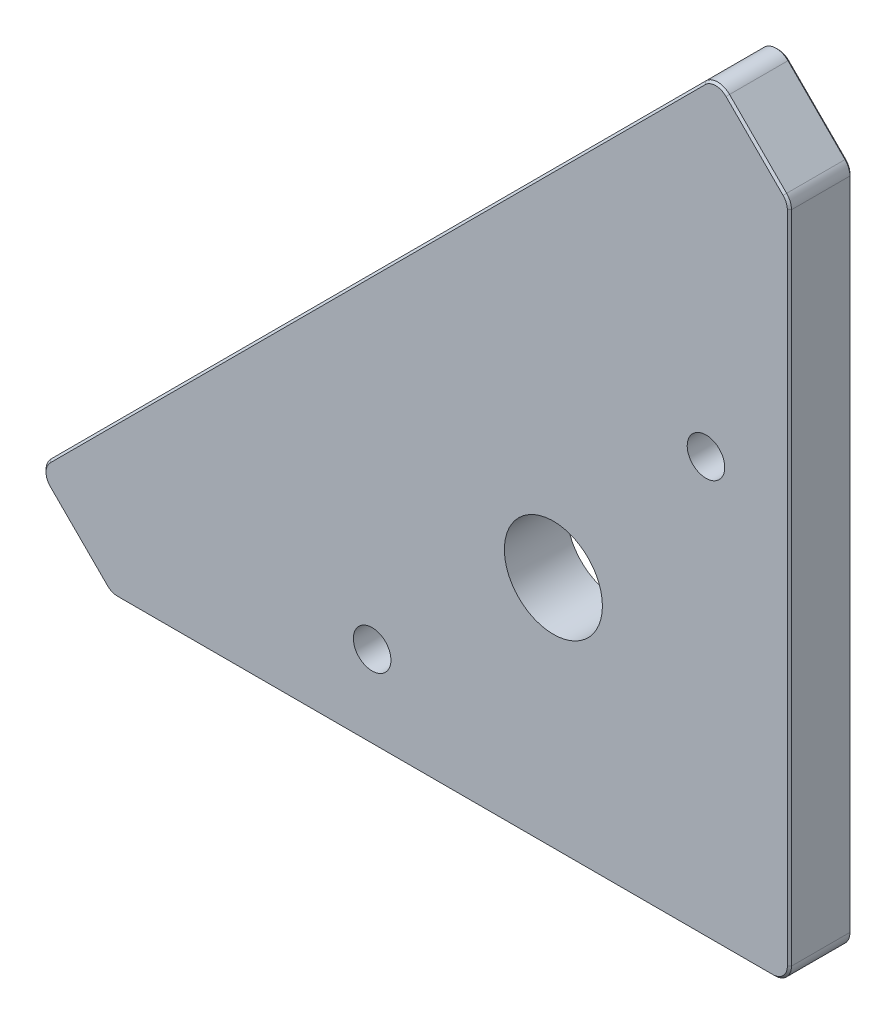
ISO-10303-21;
HEADER;
FILE_DESCRIPTION(('STEP AP214'),'2;1');
FILE_NAME('part.step','',(''),(''),'','','');
FILE_SCHEMA(('AUTOMOTIVE_DESIGN { 1 0 10303 214 1 1 1 1 }'));
ENDSEC;
DATA;
#1=APPLICATION_CONTEXT('core data for automotive mechanical design processes');
#2=APPLICATION_PROTOCOL_DEFINITION('international standard','automotive_design',2000,#1);
#3=PRODUCT_CONTEXT('',#1,'mechanical');
#4=PRODUCT('Part','Part','',(#3));
#5=PRODUCT_RELATED_PRODUCT_CATEGORY('part','',(#4));
#6=PRODUCT_DEFINITION_FORMATION('','',#4);
#7=PRODUCT_DEFINITION_CONTEXT('part definition',#1,'design');
#8=PRODUCT_DEFINITION('design','',#6,#7);
#9=PRODUCT_DEFINITION_SHAPE('','',#8);
#10=(LENGTH_UNIT() NAMED_UNIT(*) SI_UNIT(.MILLI.,.METRE.));
#11=(NAMED_UNIT(*) PLANE_ANGLE_UNIT() SI_UNIT($,.RADIAN.));
#12=(NAMED_UNIT(*) SI_UNIT($,.STERADIAN.) SOLID_ANGLE_UNIT());
#13=UNCERTAINTY_MEASURE_WITH_UNIT(LENGTH_MEASURE(1.E-05),#10,'distance_accuracy_value','');
#14=(GEOMETRIC_REPRESENTATION_CONTEXT(3) GLOBAL_UNCERTAINTY_ASSIGNED_CONTEXT((#13)) GLOBAL_UNIT_ASSIGNED_CONTEXT((#10,
#11,#12)) REPRESENTATION_CONTEXT('',''));
#15=CARTESIAN_POINT('',(0.,0.,0.));
#16=DIRECTION('',(0.,0.,1.));
#17=DIRECTION('',(1.,0.,0.));
#18=AXIS2_PLACEMENT_3D('',#15,#16,#17);
#19=CARTESIAN_POINT('',(0.,197.989898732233,15.));
#20=DIRECTION('',(-1.,0.,0.));
#21=DIRECTION('',(0.,0.,1.));
#22=AXIS2_PLACEMENT_3D('',#19,#20,#21);
#23=PLANE('',#22);
#24=DIRECTION('',(0.,0.,-1.));
#25=VECTOR('',#24,1.);
#26=CARTESIAN_POINT('',(0.,160.977705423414,15.));
#27=LINE('',#26,#25);
#28=CARTESIAN_POINT('',(0.,160.977705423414,0.499999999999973));
#29=VERTEX_POINT('',#28);
#30=CARTESIAN_POINT('',(0.,160.977705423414,14.5));
#31=VERTEX_POINT('',#30);
#32=EDGE_CURVE('E392',#29,#31,#27,.F.);
#33=ORIENTED_EDGE('',*,*,#32,.T.);
#34=DIRECTION('',(0.,-1.,0.));
#35=VECTOR('',#34,1.);
#36=CARTESIAN_POINT('',(0.,197.989898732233,14.5));
#37=LINE('',#36,#35);
#38=CARTESIAN_POINT('',(0.,4.,14.5));
#39=VERTEX_POINT('',#38);
#40=EDGE_CURVE('E330',#31,#39,#37,.T.);
#41=ORIENTED_EDGE('',*,*,#40,.T.);
#42=DIRECTION('',(0.,0.,-1.));
#43=VECTOR('',#42,1.);
#44=CARTESIAN_POINT('',(0.,4.,15.));
#45=LINE('',#44,#43);
#46=CARTESIAN_POINT('',(0.,4.,0.499999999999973));
#47=VERTEX_POINT('',#46);
#48=EDGE_CURVE('E395',#39,#47,#45,.T.);
#49=ORIENTED_EDGE('',*,*,#48,.T.);
#50=DIRECTION('',(0.,1.,0.));
#51=VECTOR('',#50,1.);
#52=CARTESIAN_POINT('',(0.,160.977705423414,0.499999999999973));
#53=LINE('',#52,#51);
#54=EDGE_CURVE('E334',#47,#29,#53,.T.);
#55=ORIENTED_EDGE('',*,*,#54,.T.);
#56=EDGE_LOOP('',(#33,#41,#49,#55));
#57=FACE_BOUND('',#56,.T.);
#58=ADVANCED_FACE('F37',(#57),#23,.F.);
#59=CARTESIAN_POINT('',(-197.989898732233,0.,15.));
#60=DIRECTION('',(0.707106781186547,-0.707106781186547,0.));
#61=DIRECTION('',(0.707106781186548,0.707106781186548,0.));
#62=AXIS2_PLACEMENT_3D('',#59,#60,#61);
#63=PLANE('',#62);
#64=DIRECTION('',(0.,0.,-1.));
#65=VECTOR('',#64,1.);
#66=CARTESIAN_POINT('',(-177.483802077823,20.5060966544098,15.));
#67=LINE('',#66,#65);
#68=CARTESIAN_POINT('',(-177.483802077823,20.5060966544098,0.499999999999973));
#69=VERTEX_POINT('',#68);
#70=CARTESIAN_POINT('',(-177.483802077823,20.5060966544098,14.5));
#71=VERTEX_POINT('',#70);
#72=EDGE_CURVE('E400',#69,#71,#67,.F.);
#73=ORIENTED_EDGE('',*,*,#72,.T.);
#74=DIRECTION('',(0.707106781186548,0.707106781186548,0.));
#75=VECTOR('',#74,1.);
#76=CARTESIAN_POINT('',(-197.989898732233,0.,14.5));
#77=LINE('',#76,#75);
#78=CARTESIAN_POINT('',(-20.5060966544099,177.483802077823,14.5));
#79=VERTEX_POINT('',#78);
#80=EDGE_CURVE('E295',#71,#79,#77,.T.);
#81=ORIENTED_EDGE('',*,*,#80,.T.);
#82=DIRECTION('',(0.,0.,-1.));
#83=VECTOR('',#82,1.);
#84=CARTESIAN_POINT('',(-20.5060966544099,177.483802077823,15.));
#85=LINE('',#84,#83);
#86=CARTESIAN_POINT('',(-20.5060966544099,177.483802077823,0.499999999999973));
#87=VERTEX_POINT('',#86);
#88=EDGE_CURVE('E358',#79,#87,#85,.T.);
#89=ORIENTED_EDGE('',*,*,#88,.T.);
#90=DIRECTION('',(-0.707106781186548,-0.707106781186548,0.));
#91=VECTOR('',#90,1.);
#92=CARTESIAN_POINT('',(-177.483802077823,20.5060966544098,0.499999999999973));
#93=LINE('',#92,#91);
#94=EDGE_CURVE('E293',#87,#69,#93,.T.);
#95=ORIENTED_EDGE('',*,*,#94,.T.);
#96=EDGE_LOOP('',(#73,#81,#89,#95));
#97=FACE_BOUND('',#96,.T.);
#98=ADVANCED_FACE('F417',(#97),#63,.F.);
#99=CARTESIAN_POINT('',(0.,0.,15.));
#100=DIRECTION('',(0.,1.,0.));
#101=DIRECTION('',(0.,0.,1.));
#102=AXIS2_PLACEMENT_3D('',#99,#100,#101);
#103=PLANE('',#102);
#104=DIRECTION('',(0.,0.,-1.));
#105=VECTOR('',#104,1.);
#106=CARTESIAN_POINT('',(-4.,0.,15.));
#107=LINE('',#106,#105);
#108=CARTESIAN_POINT('',(-4.,0.,0.499999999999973));
#109=VERTEX_POINT('',#108);
#110=CARTESIAN_POINT('',(-4.,0.,14.5));
#111=VERTEX_POINT('',#110);
#112=EDGE_CURVE('E508',#109,#111,#107,.F.);
#113=ORIENTED_EDGE('',*,*,#112,.T.);
#114=DIRECTION('',(-1.,0.,0.));
#115=VECTOR('',#114,1.);
#116=CARTESIAN_POINT('',(0.,0.,14.5));
#117=LINE('',#116,#115);
#118=CARTESIAN_POINT('',(-160.977705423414,0.,14.5));
#119=VERTEX_POINT('',#118);
#120=EDGE_CURVE('E329',#111,#119,#117,.T.);
#121=ORIENTED_EDGE('',*,*,#120,.T.);
#122=DIRECTION('',(0.,0.,-1.));
#123=VECTOR('',#122,1.);
#124=CARTESIAN_POINT('',(-160.977705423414,0.,15.));
#125=LINE('',#124,#123);
#126=CARTESIAN_POINT('',(-160.977705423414,0.,0.499999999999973));
#127=VERTEX_POINT('',#126);
#128=EDGE_CURVE('E200',#119,#127,#125,.T.);
#129=ORIENTED_EDGE('',*,*,#128,.T.);
#130=DIRECTION('',(1.,0.,0.));
#131=VECTOR('',#130,1.);
#132=CARTESIAN_POINT('',(-4.,0.,0.499999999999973));
#133=LINE('',#132,#131);
#134=EDGE_CURVE('E324',#127,#109,#133,.T.);
#135=ORIENTED_EDGE('',*,*,#134,.T.);
#136=EDGE_LOOP('',(#113,#121,#129,#135));
#137=FACE_BOUND('',#136,.T.);
#138=ADVANCED_FACE('F422',(#137),#103,.F.);
#139=CARTESIAN_POINT('',(0.,0.,15.));
#140=DIRECTION('',(0.,0.,-1.));
#141=DIRECTION('',(-1.,0.,0.));
#142=AXIS2_PLACEMENT_3D('',#139,#140,#141);
#143=PLANE('',#142);
#144=DIRECTION('',(1.,0.,0.));
#145=VECTOR('',#144,1.);
#146=CARTESIAN_POINT('',(0.,0.500000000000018,15.));
#147=LINE('',#146,#145);
#148=CARTESIAN_POINT('',(-160.977705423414,0.500000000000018,15.));
#149=VERTEX_POINT('',#148);
#150=CARTESIAN_POINT('',(-4.,0.500000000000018,15.));
#151=VERTEX_POINT('',#150);
#152=EDGE_CURVE('E371',#149,#151,#147,.T.);
#153=ORIENTED_EDGE('',*,*,#152,.T.);
#154=CARTESIAN_POINT('',(-4.,4.,15.));
#155=DIRECTION('',(0.,0.,-1.));
#156=DIRECTION('',(-1.,0.,0.));
#157=AXIS2_PLACEMENT_3D('',#154,#155,#156);
#158=CIRCLE('',#157,3.49999999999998);
#159=CARTESIAN_POINT('',(-0.500000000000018,4.,15.));
#160=VERTEX_POINT('',#159);
#161=EDGE_CURVE('E379',#151,#160,#158,.F.);
#162=ORIENTED_EDGE('',*,*,#161,.T.);
#163=DIRECTION('',(0.,1.,0.));
#164=VECTOR('',#163,1.);
#165=CARTESIAN_POINT('',(-0.500000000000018,0.,15.));
#166=LINE('',#165,#164);
#167=CARTESIAN_POINT('',(-0.500000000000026,160.977705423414,15.));
#168=VERTEX_POINT('',#167);
#169=EDGE_CURVE('E377',#160,#168,#166,.T.);
#170=ORIENTED_EDGE('',*,*,#169,.T.);
#171=CARTESIAN_POINT('',(-4.,160.977705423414,15.));
#172=DIRECTION('',(0.,0.,-1.));
#173=DIRECTION('',(-1.,0.,0.));
#174=AXIS2_PLACEMENT_3D('',#171,#172,#173);
#175=CIRCLE('',#174,3.49999999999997);
#176=CARTESIAN_POINT('',(-1.52512626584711,163.452579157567,15.));
#177=VERTEX_POINT('',#176);
#178=EDGE_CURVE('E369',#168,#177,#175,.F.);
#179=ORIENTED_EDGE('',*,*,#178,.T.);
#180=DIRECTION('',(-0.707106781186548,0.707106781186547,0.));
#181=VECTOR('',#180,1.);
#182=CARTESIAN_POINT('',(80.9637264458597,80.9637264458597,15.));
#183=LINE('',#182,#181);
#184=CARTESIAN_POINT('',(-15.2027957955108,177.13024868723,15.));
#185=VERTEX_POINT('',#184);
#186=EDGE_CURVE('E183',#177,#185,#183,.T.);
#187=ORIENTED_EDGE('',*,*,#186,.T.);
#188=CARTESIAN_POINT('',(-17.6776695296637,174.655374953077,15.));
#189=DIRECTION('',(0.,0.,-1.));
#190=DIRECTION('',(-1.,0.,0.));
#191=AXIS2_PLACEMENT_3D('',#188,#189,#190);
#192=CIRCLE('',#191,3.49999999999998);
#193=CARTESIAN_POINT('',(-20.1525432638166,177.13024868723,15.));
#194=VERTEX_POINT('',#193);
#195=EDGE_CURVE('E176',#185,#194,#192,.F.);
#196=ORIENTED_EDGE('',*,*,#195,.T.);
#197=DIRECTION('',(-0.707106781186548,-0.707106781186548,0.));
#198=VECTOR('',#197,1.);
#199=CARTESIAN_POINT('',(-98.6413959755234,98.6413959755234,15.));
#200=LINE('',#199,#198);
#201=CARTESIAN_POINT('',(-177.13024868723,20.1525432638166,15.));
#202=VERTEX_POINT('',#201);
#203=EDGE_CURVE('E180',#194,#202,#200,.T.);
#204=ORIENTED_EDGE('',*,*,#203,.T.);
#205=CARTESIAN_POINT('',(-174.655374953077,17.6776695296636,15.));
#206=DIRECTION('',(0.,0.,-1.));
#207=DIRECTION('',(-1.,0.,0.));
#208=AXIS2_PLACEMENT_3D('',#205,#206,#207);
#209=CIRCLE('',#208,3.49999999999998);
#210=CARTESIAN_POINT('',(-177.13024868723,15.2027957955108,15.));
#211=VERTEX_POINT('',#210);
#212=EDGE_CURVE('E189',#202,#211,#209,.F.);
#213=ORIENTED_EDGE('',*,*,#212,.T.);
#214=DIRECTION('',(0.707106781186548,-0.707106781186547,0.));
#215=VECTOR('',#214,1.);
#216=CARTESIAN_POINT('',(-80.9637264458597,-80.9637264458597,15.));
#217=LINE('',#216,#215);
#218=CARTESIAN_POINT('',(-163.452579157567,1.52512626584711,15.));
#219=VERTEX_POINT('',#218);
#220=EDGE_CURVE('E188',#211,#219,#217,.T.);
#221=ORIENTED_EDGE('',*,*,#220,.T.);
#222=CARTESIAN_POINT('',(-160.977705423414,4.,15.));
#223=DIRECTION('',(0.,0.,-1.));
#224=DIRECTION('',(-1.,0.,0.));
#225=AXIS2_PLACEMENT_3D('',#222,#223,#224);
#226=CIRCLE('',#225,3.49999999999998);
#227=EDGE_CURVE('E367',#219,#149,#226,.F.);
#228=ORIENTED_EDGE('',*,*,#227,.T.);
#229=EDGE_LOOP('',(#153,#162,#170,#179,#187,#196,#204,#213,#221,#228));
#230=FACE_BOUND('',#229,.T.);
#231=CARTESIAN_POINT('',(-20.,100.,15.));
#232=DIRECTION('',(0.,0.,-1.));
#233=DIRECTION('',(-1.,0.,0.));
#234=AXIS2_PLACEMENT_3D('',#231,#232,#233);
#235=CIRCLE('',#234,4.5);
#236=CARTESIAN_POINT('',(-24.5,100.,15.));
#237=VERTEX_POINT('',#236);
#238=EDGE_CURVE('E543',#237,#237,#235,.T.);
#239=ORIENTED_EDGE('',*,*,#238,.T.);
#240=EDGE_LOOP('',(#239));
#241=FACE_BOUND('',#240,.T.);
#242=CARTESIAN_POINT('',(-100.,20.,15.));
#243=DIRECTION('',(0.,0.,-1.));
#244=DIRECTION('',(-1.,0.,0.));
#245=AXIS2_PLACEMENT_3D('',#242,#243,#244);
#246=CIRCLE('',#245,4.5);
#247=CARTESIAN_POINT('',(-104.5,20.,15.));
#248=VERTEX_POINT('',#247);
#249=EDGE_CURVE('E534',#248,#248,#246,.T.);
#250=ORIENTED_EDGE('',*,*,#249,.T.);
#251=EDGE_LOOP('',(#250));
#252=FACE_BOUND('',#251,.T.);
#253=CARTESIAN_POINT('',(-56.5685424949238,56.5685424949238,15.));
#254=DIRECTION('',(0.,0.,1.));
#255=DIRECTION('',(1.,0.,0.));
#256=AXIS2_PLACEMENT_3D('',#253,#254,#255);
#257=CIRCLE('',#256,11.75);
#258=CARTESIAN_POINT('',(-44.8185424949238,56.5685424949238,15.));
#259=VERTEX_POINT('',#258);
#260=EDGE_CURVE('E517',#259,#259,#257,.T.);
#261=ORIENTED_EDGE('',*,*,#260,.F.);
#262=EDGE_LOOP('',(#261));
#263=FACE_BOUND('',#262,.T.);
#264=ADVANCED_FACE('F178',(#230,#241,#252,#263),#143,.F.);
#265=CARTESIAN_POINT('',(0.,0.,0.));
#266=DIRECTION('',(0.,0.,-1.));
#267=DIRECTION('',(-1.,0.,0.));
#268=AXIS2_PLACEMENT_3D('',#265,#266,#267);
#269=PLANE('',#268);
#270=DIRECTION('',(0.,-1.,0.));
#271=VECTOR('',#270,1.);
#272=CARTESIAN_POINT('',(-0.499999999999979,4.,0.));
#273=LINE('',#272,#271);
#274=CARTESIAN_POINT('',(-0.499999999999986,160.977705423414,0.));
#275=VERTEX_POINT('',#274);
#276=CARTESIAN_POINT('',(-0.499999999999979,4.,0.));
#277=VERTEX_POINT('',#276);
#278=EDGE_CURVE('E46',#275,#277,#273,.T.);
#279=ORIENTED_EDGE('',*,*,#278,.T.);
#280=CARTESIAN_POINT('',(-4.,4.,0.));
#281=DIRECTION('',(0.,0.,-1.));
#282=DIRECTION('',(-1.,0.,0.));
#283=AXIS2_PLACEMENT_3D('',#280,#281,#282);
#284=CIRCLE('',#283,3.50000000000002);
#285=CARTESIAN_POINT('',(-4.,0.499999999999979,0.));
#286=VERTEX_POINT('',#285);
#287=EDGE_CURVE('E11',#277,#286,#284,.T.);
#288=ORIENTED_EDGE('',*,*,#287,.T.);
#289=DIRECTION('',(-1.,0.,0.));
#290=VECTOR('',#289,1.);
#291=CARTESIAN_POINT('',(-160.977705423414,0.499999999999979,0.));
#292=LINE('',#291,#290);
#293=CARTESIAN_POINT('',(-160.977705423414,0.499999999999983,0.));
#294=VERTEX_POINT('',#293);
#295=EDGE_CURVE('E311',#286,#294,#292,.T.);
#296=ORIENTED_EDGE('',*,*,#295,.T.);
#297=CARTESIAN_POINT('',(-160.977705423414,4.,0.));
#298=DIRECTION('',(0.,0.,-1.));
#299=DIRECTION('',(-1.,0.,0.));
#300=AXIS2_PLACEMENT_3D('',#297,#298,#299);
#301=CIRCLE('',#300,3.50000000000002);
#302=CARTESIAN_POINT('',(-163.452579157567,1.52512626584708,0.));
#303=VERTEX_POINT('',#302);
#304=EDGE_CURVE('E307',#294,#303,#301,.T.);
#305=ORIENTED_EDGE('',*,*,#304,.T.);
#306=DIRECTION('',(-0.707106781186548,0.707106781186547,0.));
#307=VECTOR('',#306,1.);
#308=CARTESIAN_POINT('',(-177.13024868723,15.2027957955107,0.));
#309=LINE('',#308,#307);
#310=CARTESIAN_POINT('',(-177.13024868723,15.2027957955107,0.));
#311=VERTEX_POINT('',#310);
#312=EDGE_CURVE('E303',#303,#311,#309,.T.);
#313=ORIENTED_EDGE('',*,*,#312,.T.);
#314=CARTESIAN_POINT('',(-174.655374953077,17.6776695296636,0.));
#315=DIRECTION('',(0.,0.,-1.));
#316=DIRECTION('',(-1.,0.,0.));
#317=AXIS2_PLACEMENT_3D('',#314,#315,#316);
#318=CIRCLE('',#317,3.50000000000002);
#319=CARTESIAN_POINT('',(-177.13024868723,20.1525432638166,0.));
#320=VERTEX_POINT('',#319);
#321=EDGE_CURVE('E299',#311,#320,#318,.T.);
#322=ORIENTED_EDGE('',*,*,#321,.T.);
#323=DIRECTION('',(0.707106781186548,0.707106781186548,0.));
#324=VECTOR('',#323,1.);
#325=CARTESIAN_POINT('',(-20.1525432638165,177.13024868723,0.));
#326=LINE('',#325,#324);
#327=CARTESIAN_POINT('',(-20.1525432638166,177.13024868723,0.));
#328=VERTEX_POINT('',#327);
#329=EDGE_CURVE('E297',#320,#328,#326,.T.);
#330=ORIENTED_EDGE('',*,*,#329,.T.);
#331=CARTESIAN_POINT('',(-17.6776695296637,174.655374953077,0.));
#332=DIRECTION('',(0.,0.,-1.));
#333=DIRECTION('',(-1.,0.,0.));
#334=AXIS2_PLACEMENT_3D('',#331,#332,#333);
#335=CIRCLE('',#334,3.50000000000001);
#336=CARTESIAN_POINT('',(-15.2027957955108,177.13024868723,0.));
#337=VERTEX_POINT('',#336);
#338=EDGE_CURVE('E301',#328,#337,#335,.T.);
#339=ORIENTED_EDGE('',*,*,#338,.T.);
#340=DIRECTION('',(0.707106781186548,-0.707106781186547,0.));
#341=VECTOR('',#340,1.);
#342=CARTESIAN_POINT('',(-1.52512626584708,163.452579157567,0.));
#343=LINE('',#342,#341);
#344=CARTESIAN_POINT('',(-1.52512626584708,163.452579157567,0.));
#345=VERTEX_POINT('',#344);
#346=EDGE_CURVE('E305',#337,#345,#343,.T.);
#347=ORIENTED_EDGE('',*,*,#346,.T.);
#348=CARTESIAN_POINT('',(-4.,160.977705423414,0.));
#349=DIRECTION('',(0.,0.,-1.));
#350=DIRECTION('',(-1.,0.,0.));
#351=AXIS2_PLACEMENT_3D('',#348,#349,#350);
#352=CIRCLE('',#351,3.50000000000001);
#353=EDGE_CURVE('E309',#345,#275,#352,.T.);
#354=ORIENTED_EDGE('',*,*,#353,.T.);
#355=EDGE_LOOP('',(#279,#288,#296,#305,#313,#322,#330,#339,#347,#354));
#356=FACE_BOUND('',#355,.T.);
#357=CARTESIAN_POINT('',(-20.,100.,0.));
#358=DIRECTION('',(0.,0.,-1.));
#359=DIRECTION('',(-1.,0.,0.));
#360=AXIS2_PLACEMENT_3D('',#357,#358,#359);
#361=CIRCLE('',#360,9.125);
#362=CARTESIAN_POINT('',(-29.125,100.,0.));
#363=VERTEX_POINT('',#362);
#364=EDGE_CURVE('E206',#363,#363,#361,.T.);
#365=ORIENTED_EDGE('',*,*,#364,.F.);
#366=EDGE_LOOP('',(#365));
#367=FACE_BOUND('',#366,.T.);
#368=CARTESIAN_POINT('',(-100.,20.,0.));
#369=DIRECTION('',(0.,0.,-1.));
#370=DIRECTION('',(-1.,0.,0.));
#371=AXIS2_PLACEMENT_3D('',#368,#369,#370);
#372=CIRCLE('',#371,9.12499999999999);
#373=CARTESIAN_POINT('',(-109.125,20.,0.));
#374=VERTEX_POINT('',#373);
#375=EDGE_CURVE('E540',#374,#374,#372,.T.);
#376=ORIENTED_EDGE('',*,*,#375,.F.);
#377=EDGE_LOOP('',(#376));
#378=FACE_BOUND('',#377,.T.);
#379=CARTESIAN_POINT('',(-56.5685424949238,56.5685424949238,0.));
#380=DIRECTION('',(0.,0.,-1.));
#381=DIRECTION('',(-1.,0.,0.));
#382=AXIS2_PLACEMENT_3D('',#379,#380,#381);
#383=CIRCLE('',#382,11.75);
#384=CARTESIAN_POINT('',(-68.3185424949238,56.5685424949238,0.));
#385=VERTEX_POINT('',#384);
#386=EDGE_CURVE('E514',#385,#385,#383,.T.);
#387=ORIENTED_EDGE('',*,*,#386,.F.);
#388=EDGE_LOOP('',(#387));
#389=FACE_BOUND('',#388,.T.);
#390=ADVANCED_FACE('F313',(#356,#367,#378,#389),#269,.T.);
#391=CARTESIAN_POINT('',(-162.634559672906,0.,15.));
#392=DIRECTION('',(0.707106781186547,0.707106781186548,0.));
#393=DIRECTION('',(-0.707106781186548,0.707106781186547,0.));
#394=AXIS2_PLACEMENT_3D('',#391,#392,#393);
#395=PLANE('',#394);
#396=DIRECTION('',(0.,0.,-1.));
#397=VECTOR('',#396,1.);
#398=CARTESIAN_POINT('',(-163.80613254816,1.17157287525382,15.));
#399=LINE('',#398,#397);
#400=CARTESIAN_POINT('',(-163.80613254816,1.17157287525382,0.499999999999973));
#401=VERTEX_POINT('',#400);
#402=CARTESIAN_POINT('',(-163.80613254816,1.17157287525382,14.5));
#403=VERTEX_POINT('',#402);
#404=EDGE_CURVE('E348',#401,#403,#399,.F.);
#405=ORIENTED_EDGE('',*,*,#404,.T.);
#406=DIRECTION('',(-0.707106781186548,0.707106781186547,0.));
#407=VECTOR('',#406,1.);
#408=CARTESIAN_POINT('',(-162.634559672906,0.,14.5));
#409=LINE('',#408,#407);
#410=CARTESIAN_POINT('',(-177.483802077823,14.8492424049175,14.5));
#411=VERTEX_POINT('',#410);
#412=EDGE_CURVE('E279',#403,#411,#409,.T.);
#413=ORIENTED_EDGE('',*,*,#412,.T.);
#414=DIRECTION('',(0.,0.,-1.));
#415=VECTOR('',#414,1.);
#416=CARTESIAN_POINT('',(-177.483802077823,14.8492424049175,15.));
#417=LINE('',#416,#415);
#418=CARTESIAN_POINT('',(-177.483802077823,14.8492424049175,0.499999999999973));
#419=VERTEX_POINT('',#418);
#420=EDGE_CURVE('E357',#411,#419,#417,.T.);
#421=ORIENTED_EDGE('',*,*,#420,.T.);
#422=DIRECTION('',(0.707106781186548,-0.707106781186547,0.));
#423=VECTOR('',#422,1.);
#424=CARTESIAN_POINT('',(-163.80613254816,1.17157287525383,0.499999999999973));
#425=LINE('',#424,#423);
#426=EDGE_CURVE('E276',#419,#401,#425,.T.);
#427=ORIENTED_EDGE('',*,*,#426,.T.);
#428=EDGE_LOOP('',(#405,#413,#421,#427));
#429=FACE_BOUND('',#428,.T.);
#430=ADVANCED_FACE('F353',(#429),#395,.F.);
#431=CARTESIAN_POINT('',(0.,162.634559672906,15.));
#432=DIRECTION('',(-0.707106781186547,-0.707106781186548,0.));
#433=DIRECTION('',(0.707106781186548,-0.707106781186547,0.));
#434=AXIS2_PLACEMENT_3D('',#431,#432,#433);
#435=PLANE('',#434);
#436=DIRECTION('',(0.,0.,-1.));
#437=VECTOR('',#436,1.);
#438=CARTESIAN_POINT('',(-14.8492424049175,177.483802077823,15.));
#439=LINE('',#438,#437);
#440=CARTESIAN_POINT('',(-14.8492424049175,177.483802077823,0.499999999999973));
#441=VERTEX_POINT('',#440);
#442=CARTESIAN_POINT('',(-14.8492424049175,177.483802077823,14.5));
#443=VERTEX_POINT('',#442);
#444=EDGE_CURVE('E516',#441,#443,#439,.F.);
#445=ORIENTED_EDGE('',*,*,#444,.T.);
#446=DIRECTION('',(0.707106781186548,-0.707106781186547,0.));
#447=VECTOR('',#446,1.);
#448=CARTESIAN_POINT('',(0.,162.634559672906,14.5));
#449=LINE('',#448,#447);
#450=CARTESIAN_POINT('',(-1.17157287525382,163.80613254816,14.5));
#451=VERTEX_POINT('',#450);
#452=EDGE_CURVE('E270',#443,#451,#449,.T.);
#453=ORIENTED_EDGE('',*,*,#452,.T.);
#454=DIRECTION('',(0.,0.,-1.));
#455=VECTOR('',#454,1.);
#456=CARTESIAN_POINT('',(-1.17157287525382,163.80613254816,15.));
#457=LINE('',#456,#455);
#458=CARTESIAN_POINT('',(-1.17157287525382,163.80613254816,0.499999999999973));
#459=VERTEX_POINT('',#458);
#460=EDGE_CURVE('E529',#451,#459,#457,.T.);
#461=ORIENTED_EDGE('',*,*,#460,.T.);
#462=DIRECTION('',(-0.707106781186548,0.707106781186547,0.));
#463=VECTOR('',#462,1.);
#464=CARTESIAN_POINT('',(-14.8492424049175,177.483802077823,0.499999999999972));
#465=LINE('',#464,#463);
#466=EDGE_CURVE('E277',#459,#441,#465,.T.);
#467=ORIENTED_EDGE('',*,*,#466,.T.);
#468=EDGE_LOOP('',(#445,#453,#461,#467));
#469=FACE_BOUND('',#468,.T.);
#470=ADVANCED_FACE('F430',(#469),#435,.F.);
#471=CARTESIAN_POINT('',(-4.,160.977705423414,15.));
#472=DIRECTION('',(0.,0.,-1.));
#473=DIRECTION('',(-1.,0.,0.));
#474=AXIS2_PLACEMENT_3D('',#471,#472,#473);
#475=CYLINDRICAL_SURFACE('',#474,4.);
#476=ORIENTED_EDGE('',*,*,#460,.F.);
#477=CARTESIAN_POINT('',(-4.,160.977705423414,14.5));
#478=DIRECTION('',(0.,0.,-1.));
#479=DIRECTION('',(-1.,0.,0.));
#480=AXIS2_PLACEMENT_3D('',#477,#478,#479);
#481=CIRCLE('',#480,4.);
#482=EDGE_CURVE('E339',#451,#31,#481,.T.);
#483=ORIENTED_EDGE('',*,*,#482,.T.);
#484=ORIENTED_EDGE('',*,*,#32,.F.);
#485=CARTESIAN_POINT('',(-4.,160.977705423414,0.499999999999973));
#486=DIRECTION('',(0.,0.,-1.));
#487=DIRECTION('',(-1.,0.,0.));
#488=AXIS2_PLACEMENT_3D('',#485,#486,#487);
#489=CIRCLE('',#488,4.);
#490=EDGE_CURVE('E332',#29,#459,#489,.F.);
#491=ORIENTED_EDGE('',*,*,#490,.T.);
#492=EDGE_LOOP('',(#476,#483,#484,#491));
#493=FACE_BOUND('',#492,.T.);
#494=ADVANCED_FACE('F399',(#493),#475,.T.);
#495=CARTESIAN_POINT('',(-17.6776695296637,174.655374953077,15.));
#496=DIRECTION('',(0.,0.,-1.));
#497=DIRECTION('',(-1.,0.,0.));
#498=AXIS2_PLACEMENT_3D('',#495,#496,#497);
#499=CYLINDRICAL_SURFACE('',#498,4.);
#500=ORIENTED_EDGE('',*,*,#88,.F.);
#501=CARTESIAN_POINT('',(-17.6776695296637,174.655374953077,14.5));
#502=DIRECTION('',(0.,0.,-1.));
#503=DIRECTION('',(-1.,0.,0.));
#504=AXIS2_PLACEMENT_3D('',#501,#502,#503);
#505=CIRCLE('',#504,4.);
#506=EDGE_CURVE('E203',#79,#443,#505,.T.);
#507=ORIENTED_EDGE('',*,*,#506,.T.);
#508=ORIENTED_EDGE('',*,*,#444,.F.);
#509=CARTESIAN_POINT('',(-17.6776695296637,174.655374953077,0.499999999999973));
#510=DIRECTION('',(0.,0.,-1.));
#511=DIRECTION('',(-1.,0.,0.));
#512=AXIS2_PLACEMENT_3D('',#509,#510,#511);
#513=CIRCLE('',#512,4.);
#514=EDGE_CURVE('E286',#441,#87,#513,.F.);
#515=ORIENTED_EDGE('',*,*,#514,.T.);
#516=EDGE_LOOP('',(#500,#507,#508,#515));
#517=FACE_BOUND('',#516,.T.);
#518=ADVANCED_FACE('F429',(#517),#499,.T.);
#519=CARTESIAN_POINT('',(-174.655374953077,17.6776695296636,15.));
#520=DIRECTION('',(0.,0.,-1.));
#521=DIRECTION('',(-1.,0.,0.));
#522=AXIS2_PLACEMENT_3D('',#519,#520,#521);
#523=CYLINDRICAL_SURFACE('',#522,4.);
#524=ORIENTED_EDGE('',*,*,#420,.F.);
#525=CARTESIAN_POINT('',(-174.655374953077,17.6776695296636,14.5));
#526=DIRECTION('',(0.,0.,-1.));
#527=DIRECTION('',(-1.,0.,0.));
#528=AXIS2_PLACEMENT_3D('',#525,#526,#527);
#529=CIRCLE('',#528,4.);
#530=EDGE_CURVE('E291',#411,#71,#529,.T.);
#531=ORIENTED_EDGE('',*,*,#530,.T.);
#532=ORIENTED_EDGE('',*,*,#72,.F.);
#533=CARTESIAN_POINT('',(-174.655374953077,17.6776695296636,0.499999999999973));
#534=DIRECTION('',(0.,0.,-1.));
#535=DIRECTION('',(-1.,0.,0.));
#536=AXIS2_PLACEMENT_3D('',#533,#534,#535);
#537=CIRCLE('',#536,4.);
#538=EDGE_CURVE('E289',#69,#419,#537,.F.);
#539=ORIENTED_EDGE('',*,*,#538,.T.);
#540=EDGE_LOOP('',(#524,#531,#532,#539));
#541=FACE_BOUND('',#540,.T.);
#542=ADVANCED_FACE('F433',(#541),#523,.T.);
#543=CARTESIAN_POINT('',(-160.977705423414,4.,15.));
#544=DIRECTION('',(0.,0.,-1.));
#545=DIRECTION('',(-1.,0.,0.));
#546=AXIS2_PLACEMENT_3D('',#543,#544,#545);
#547=CYLINDRICAL_SURFACE('',#546,4.);
#548=ORIENTED_EDGE('',*,*,#128,.F.);
#549=CARTESIAN_POINT('',(-160.977705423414,4.,14.5));
#550=DIRECTION('',(0.,0.,-1.));
#551=DIRECTION('',(-1.,0.,0.));
#552=AXIS2_PLACEMENT_3D('',#549,#550,#551);
#553=CIRCLE('',#552,4.);
#554=EDGE_CURVE('E281',#119,#403,#553,.T.);
#555=ORIENTED_EDGE('',*,*,#554,.T.);
#556=ORIENTED_EDGE('',*,*,#404,.F.);
#557=CARTESIAN_POINT('',(-160.977705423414,4.,0.499999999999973));
#558=DIRECTION('',(0.,0.,-1.));
#559=DIRECTION('',(-1.,0.,0.));
#560=AXIS2_PLACEMENT_3D('',#557,#558,#559);
#561=CIRCLE('',#560,4.);
#562=EDGE_CURVE('E341',#401,#127,#561,.F.);
#563=ORIENTED_EDGE('',*,*,#562,.T.);
#564=EDGE_LOOP('',(#548,#555,#556,#563));
#565=FACE_BOUND('',#564,.T.);
#566=ADVANCED_FACE('F347',(#565),#547,.T.);
#567=CARTESIAN_POINT('',(-4.,4.,15.));
#568=DIRECTION('',(0.,0.,-1.));
#569=DIRECTION('',(-1.,0.,0.));
#570=AXIS2_PLACEMENT_3D('',#567,#568,#569);
#571=CYLINDRICAL_SURFACE('',#570,4.);
#572=ORIENTED_EDGE('',*,*,#48,.F.);
#573=CARTESIAN_POINT('',(-4.,4.,14.5));
#574=DIRECTION('',(0.,0.,-1.));
#575=DIRECTION('',(-1.,0.,0.));
#576=AXIS2_PLACEMENT_3D('',#573,#574,#575);
#577=CIRCLE('',#576,4.);
#578=EDGE_CURVE('E385',#39,#111,#577,.T.);
#579=ORIENTED_EDGE('',*,*,#578,.T.);
#580=ORIENTED_EDGE('',*,*,#112,.F.);
#581=CARTESIAN_POINT('',(-4.,4.,0.499999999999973));
#582=DIRECTION('',(0.,0.,-1.));
#583=DIRECTION('',(-1.,0.,0.));
#584=AXIS2_PLACEMENT_3D('',#581,#582,#583);
#585=CIRCLE('',#584,4.);
#586=EDGE_CURVE('E382',#109,#47,#585,.F.);
#587=ORIENTED_EDGE('',*,*,#586,.T.);
#588=EDGE_LOOP('',(#572,#579,#580,#587));
#589=FACE_BOUND('',#588,.T.);
#590=ADVANCED_FACE('F440',(#589),#571,.T.);
#591=CARTESIAN_POINT('',(-56.5685424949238,56.5685424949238,15.));
#592=DIRECTION('',(0.,0.,1.));
#593=DIRECTION('',(1.,0.,0.));
#594=AXIS2_PLACEMENT_3D('',#591,#592,#593);
#595=CYLINDRICAL_SURFACE('',#594,11.75);
#596=ORIENTED_EDGE('',*,*,#386,.T.);
#597=EDGE_LOOP('',(#596));
#598=FACE_BOUND('',#597,.T.);
#599=ORIENTED_EDGE('',*,*,#260,.T.);
#600=EDGE_LOOP('',(#599));
#601=FACE_BOUND('',#600,.T.);
#602=ADVANCED_FACE('F443',(#598,#601),#595,.F.);
#603=CARTESIAN_POINT('',(-100.,20.,0.));
#604=DIRECTION('',(0.,0.,-1.));
#605=DIRECTION('',(-1.,0.,0.));
#606=AXIS2_PLACEMENT_3D('',#603,#604,#605);
#607=CYLINDRICAL_SURFACE('',#606,4.5);
#608=ORIENTED_EDGE('',*,*,#249,.F.);
#609=EDGE_LOOP('',(#608));
#610=FACE_BOUND('',#609,.T.);
#611=CARTESIAN_POINT('',(-100.,20.,4.62499999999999));
#612=DIRECTION('',(0.,0.,-1.));
#613=DIRECTION('',(-1.,0.,0.));
#614=AXIS2_PLACEMENT_3D('',#611,#612,#613);
#615=CIRCLE('',#614,4.49999999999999);
#616=CARTESIAN_POINT('',(-104.5,20.,4.62499999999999));
#617=VERTEX_POINT('',#616);
#618=EDGE_CURVE('E537',#617,#617,#615,.T.);
#619=ORIENTED_EDGE('',*,*,#618,.T.);
#620=EDGE_LOOP('',(#619));
#621=FACE_BOUND('',#620,.T.);
#622=ADVANCED_FACE('F490',(#610,#621),#607,.F.);
#623=CARTESIAN_POINT('',(-100.,20.,0.));
#624=DIRECTION('',(0.,0.,-1.));
#625=DIRECTION('',(-1.,0.,0.));
#626=AXIS2_PLACEMENT_3D('',#623,#624,#625);
#627=CONICAL_SURFACE('',#626,9.12499999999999,0.78539816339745);
#628=ORIENTED_EDGE('',*,*,#618,.F.);
#629=EDGE_LOOP('',(#628));
#630=FACE_BOUND('',#629,.T.);
#631=ORIENTED_EDGE('',*,*,#375,.T.);
#632=EDGE_LOOP('',(#631));
#633=FACE_BOUND('',#632,.T.);
#634=ADVANCED_FACE('F482',(#630,#633),#627,.F.);
#635=CARTESIAN_POINT('',(-20.,100.,0.));
#636=DIRECTION('',(0.,0.,-1.));
#637=DIRECTION('',(-1.,0.,0.));
#638=AXIS2_PLACEMENT_3D('',#635,#636,#637);
#639=CYLINDRICAL_SURFACE('',#638,4.49999999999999);
#640=ORIENTED_EDGE('',*,*,#238,.F.);
#641=EDGE_LOOP('',(#640));
#642=FACE_BOUND('',#641,.T.);
#643=CARTESIAN_POINT('',(-20.,100.,4.62499999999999));
#644=DIRECTION('',(0.,0.,-1.));
#645=DIRECTION('',(-1.,0.,0.));
#646=AXIS2_PLACEMENT_3D('',#643,#644,#645);
#647=CIRCLE('',#646,4.49999999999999);
#648=CARTESIAN_POINT('',(-24.5,100.,4.62499999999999));
#649=VERTEX_POINT('',#648);
#650=EDGE_CURVE('E546',#649,#649,#647,.T.);
#651=ORIENTED_EDGE('',*,*,#650,.T.);
#652=EDGE_LOOP('',(#651));
#653=FACE_BOUND('',#652,.T.);
#654=ADVANCED_FACE('F476',(#642,#653),#639,.F.);
#655=CARTESIAN_POINT('',(-20.,100.,0.));
#656=DIRECTION('',(0.,0.,-1.));
#657=DIRECTION('',(-1.,0.,0.));
#658=AXIS2_PLACEMENT_3D('',#655,#656,#657);
#659=CONICAL_SURFACE('',#658,9.125,0.78539816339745);
#660=ORIENTED_EDGE('',*,*,#650,.F.);
#661=EDGE_LOOP('',(#660));
#662=FACE_BOUND('',#661,.T.);
#663=ORIENTED_EDGE('',*,*,#364,.T.);
#664=EDGE_LOOP('',(#663));
#665=FACE_BOUND('',#664,.T.);
#666=ADVANCED_FACE('F472',(#662,#665),#659,.F.);
#667=CARTESIAN_POINT('',(-98.6413959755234,98.6413959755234,15.));
#668=DIRECTION('',(0.500000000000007,-0.500000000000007,-0.707106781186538));
#669=DIRECTION('',(-0.707106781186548,-0.707106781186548,0.));
#670=AXIS2_PLACEMENT_3D('',#667,#668,#669);
#671=PLANE('',#670);
#672=DIRECTION('',(0.5,-0.499999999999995,0.707106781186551));
#673=VECTOR('',#672,1.);
#674=CARTESIAN_POINT('',(-20.5060966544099,177.483802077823,14.5));
#675=LINE('',#674,#673);
#676=EDGE_CURVE('E195',#79,#194,#675,.T.);
#677=ORIENTED_EDGE('',*,*,#676,.F.);
#678=ORIENTED_EDGE('',*,*,#80,.F.);
#679=DIRECTION('',(-0.499999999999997,0.499999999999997,-0.707106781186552));
#680=VECTOR('',#679,1.);
#681=CARTESIAN_POINT('',(-177.13024868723,20.1525432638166,15.));
#682=LINE('',#681,#680);
#683=EDGE_CURVE('E198',#202,#71,#682,.T.);
#684=ORIENTED_EDGE('',*,*,#683,.F.);
#685=ORIENTED_EDGE('',*,*,#203,.F.);
#686=EDGE_LOOP('',(#677,#678,#684,#685));
#687=FACE_BOUND('',#686,.T.);
#688=ADVANCED_FACE('F193',(#687),#671,.F.);
#689=CARTESIAN_POINT('',(-174.655374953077,17.6776695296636,15.));
#690=DIRECTION('',(0.,0.,-1.));
#691=DIRECTION('',(-1.,0.,0.));
#692=AXIS2_PLACEMENT_3D('',#689,#690,#691);
#693=CONICAL_SURFACE('',#692,3.49999999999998,0.785398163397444);
#694=ORIENTED_EDGE('',*,*,#683,.T.);
#695=ORIENTED_EDGE('',*,*,#530,.F.);
#696=DIRECTION('',(-0.499999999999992,-0.500000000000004,-0.707106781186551));
#697=VECTOR('',#696,1.);
#698=CARTESIAN_POINT('',(-177.13024868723,15.2027957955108,15.));
#699=LINE('',#698,#697);
#700=EDGE_CURVE('E204',#211,#411,#699,.T.);
#701=ORIENTED_EDGE('',*,*,#700,.F.);
#702=ORIENTED_EDGE('',*,*,#212,.F.);
#703=EDGE_LOOP('',(#694,#695,#701,#702));
#704=FACE_BOUND('',#703,.T.);
#705=ADVANCED_FACE('F468',(#704),#693,.T.);
#706=CARTESIAN_POINT('',(-17.6776695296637,174.655374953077,15.));
#707=DIRECTION('',(0.,0.,-1.));
#708=DIRECTION('',(-1.,0.,0.));
#709=AXIS2_PLACEMENT_3D('',#706,#707,#708);
#710=CONICAL_SURFACE('',#709,3.49999999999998,0.785398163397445);
#711=ORIENTED_EDGE('',*,*,#676,.T.);
#712=ORIENTED_EDGE('',*,*,#195,.F.);
#713=DIRECTION('',(-0.5,-0.499999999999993,0.707106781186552));
#714=VECTOR('',#713,1.);
#715=CARTESIAN_POINT('',(-14.8492424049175,177.483802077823,14.5));
#716=LINE('',#715,#714);
#717=EDGE_CURVE('E209',#443,#185,#716,.T.);
#718=ORIENTED_EDGE('',*,*,#717,.F.);
#719=ORIENTED_EDGE('',*,*,#506,.F.);
#720=EDGE_LOOP('',(#711,#712,#718,#719));
#721=FACE_BOUND('',#720,.T.);
#722=ADVANCED_FACE('F202',(#721),#710,.T.);
#723=CARTESIAN_POINT('',(-80.9637264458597,-80.9637264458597,15.));
#724=DIRECTION('',(0.5,0.5,-0.707106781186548));
#725=DIRECTION('',(0.707106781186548,-0.707106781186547,0.));
#726=AXIS2_PLACEMENT_3D('',#723,#724,#725);
#727=PLANE('',#726);
#728=ORIENTED_EDGE('',*,*,#700,.T.);
#729=ORIENTED_EDGE('',*,*,#412,.F.);
#730=DIRECTION('',(-0.50000000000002,-0.499999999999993,-0.707106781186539));
#731=VECTOR('',#730,1.);
#732=CARTESIAN_POINT('',(-163.452579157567,1.52512626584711,15.));
#733=LINE('',#732,#731);
#734=EDGE_CURVE('E264',#219,#403,#733,.T.);
#735=ORIENTED_EDGE('',*,*,#734,.F.);
#736=ORIENTED_EDGE('',*,*,#220,.F.);
#737=EDGE_LOOP('',(#728,#729,#735,#736));
#738=FACE_BOUND('',#737,.T.);
#739=ADVANCED_FACE('F362',(#738),#727,.F.);
#740=CARTESIAN_POINT('',(80.9637264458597,80.9637264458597,15.));
#741=DIRECTION('',(-0.499999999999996,-0.499999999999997,-0.707106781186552));
#742=DIRECTION('',(-0.707106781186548,0.707106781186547,0.));
#743=AXIS2_PLACEMENT_3D('',#740,#741,#742);
#744=PLANE('',#743);
#745=ORIENTED_EDGE('',*,*,#717,.T.);
#746=ORIENTED_EDGE('',*,*,#186,.F.);
#747=DIRECTION('',(-0.499999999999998,-0.499999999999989,0.707106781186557));
#748=VECTOR('',#747,1.);
#749=CARTESIAN_POINT('',(-1.17157287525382,163.80613254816,14.5));
#750=LINE('',#749,#748);
#751=EDGE_CURVE('E261',#451,#177,#750,.T.);
#752=ORIENTED_EDGE('',*,*,#751,.F.);
#753=ORIENTED_EDGE('',*,*,#452,.F.);
#754=EDGE_LOOP('',(#745,#746,#752,#753));
#755=FACE_BOUND('',#754,.T.);
#756=ADVANCED_FACE('F268',(#755),#744,.F.);
#757=CARTESIAN_POINT('',(-160.977705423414,4.,15.));
#758=DIRECTION('',(0.,0.,-1.));
#759=DIRECTION('',(-1.,0.,0.));
#760=AXIS2_PLACEMENT_3D('',#757,#758,#759);
#761=CONICAL_SURFACE('',#760,3.49999999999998,0.785398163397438);
#762=ORIENTED_EDGE('',*,*,#734,.T.);
#763=ORIENTED_EDGE('',*,*,#554,.F.);
#764=DIRECTION('',(0.,-0.70710678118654,-0.707106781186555));
#765=VECTOR('',#764,1.);
#766=CARTESIAN_POINT('',(-160.977705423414,0.500000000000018,15.));
#767=LINE('',#766,#765);
#768=EDGE_CURVE('E258',#149,#119,#767,.T.);
#769=ORIENTED_EDGE('',*,*,#768,.F.);
#770=ORIENTED_EDGE('',*,*,#227,.F.);
#771=EDGE_LOOP('',(#762,#763,#769,#770));
#772=FACE_BOUND('',#771,.T.);
#773=ADVANCED_FACE('F366',(#772),#761,.T.);
#774=CARTESIAN_POINT('',(-4.,160.977705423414,15.));
#775=DIRECTION('',(0.,0.,-1.));
#776=DIRECTION('',(-1.,0.,0.));
#777=AXIS2_PLACEMENT_3D('',#774,#775,#776);
#778=CONICAL_SURFACE('',#777,3.49999999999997,0.785398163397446);
#779=ORIENTED_EDGE('',*,*,#751,.T.);
#780=ORIENTED_EDGE('',*,*,#178,.F.);
#781=DIRECTION('',(-0.707106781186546,0.,0.707106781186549));
#782=VECTOR('',#781,1.);
#783=CARTESIAN_POINT('',(0.,160.977705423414,14.5));
#784=LINE('',#783,#782);
#785=EDGE_CURVE('E252',#31,#168,#784,.T.);
#786=ORIENTED_EDGE('',*,*,#785,.F.);
#787=ORIENTED_EDGE('',*,*,#482,.F.);
#788=EDGE_LOOP('',(#779,#780,#786,#787));
#789=FACE_BOUND('',#788,.T.);
#790=ADVANCED_FACE('F455',(#789),#778,.T.);
#791=CARTESIAN_POINT('',(0.,0.500000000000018,15.));
#792=DIRECTION('',(0.,0.707106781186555,-0.70710678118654));
#793=DIRECTION('',(1.,0.,0.));
#794=AXIS2_PLACEMENT_3D('',#791,#792,#793);
#795=PLANE('',#794);
#796=ORIENTED_EDGE('',*,*,#768,.T.);
#797=ORIENTED_EDGE('',*,*,#120,.F.);
#798=DIRECTION('',(0.,-0.70710678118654,-0.707106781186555));
#799=VECTOR('',#798,1.);
#800=CARTESIAN_POINT('',(-4.,0.500000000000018,15.));
#801=LINE('',#800,#799);
#802=EDGE_CURVE('E245',#151,#111,#801,.T.);
#803=ORIENTED_EDGE('',*,*,#802,.F.);
#804=ORIENTED_EDGE('',*,*,#152,.F.);
#805=EDGE_LOOP('',(#796,#797,#803,#804));
#806=FACE_BOUND('',#805,.T.);
#807=ADVANCED_FACE('F451',(#806),#795,.F.);
#808=CARTESIAN_POINT('',(-0.500000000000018,0.,15.));
#809=DIRECTION('',(-0.707106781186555,0.,-0.70710678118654));
#810=DIRECTION('',(0.,1.,0.));
#811=AXIS2_PLACEMENT_3D('',#808,#809,#810);
#812=PLANE('',#811);
#813=ORIENTED_EDGE('',*,*,#785,.T.);
#814=ORIENTED_EDGE('',*,*,#169,.F.);
#815=DIRECTION('',(-0.70710678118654,0.,0.707106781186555));
#816=VECTOR('',#815,1.);
#817=CARTESIAN_POINT('',(0.,4.,14.5));
#818=LINE('',#817,#816);
#819=EDGE_CURVE('E240',#39,#160,#818,.T.);
#820=ORIENTED_EDGE('',*,*,#819,.F.);
#821=ORIENTED_EDGE('',*,*,#40,.F.);
#822=EDGE_LOOP('',(#813,#814,#820,#821));
#823=FACE_BOUND('',#822,.T.);
#824=ADVANCED_FACE('F448',(#823),#812,.F.);
#825=CARTESIAN_POINT('',(-4.,4.,15.));
#826=DIRECTION('',(0.,0.,-1.));
#827=DIRECTION('',(-1.,0.,0.));
#828=AXIS2_PLACEMENT_3D('',#825,#826,#827);
#829=CONICAL_SURFACE('',#828,3.49999999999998,0.785398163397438);
#830=ORIENTED_EDGE('',*,*,#802,.T.);
#831=ORIENTED_EDGE('',*,*,#578,.F.);
#832=ORIENTED_EDGE('',*,*,#819,.T.);
#833=ORIENTED_EDGE('',*,*,#161,.F.);
#834=EDGE_LOOP('',(#830,#831,#832,#833));
#835=FACE_BOUND('',#834,.T.);
#836=ADVANCED_FACE('F445',(#835),#829,.T.);
#837=CARTESIAN_POINT('',(-197.989898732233,0.,0.499999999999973));
#838=DIRECTION('',(-0.499999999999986,0.499999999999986,-0.707106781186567));
#839=DIRECTION('',(0.707106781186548,0.707106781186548,0.));
#840=AXIS2_PLACEMENT_3D('',#837,#838,#839);
#841=PLANE('',#840);
#842=DIRECTION('',(0.500000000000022,-0.500000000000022,-0.707106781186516));
#843=VECTOR('',#842,1.);
#844=CARTESIAN_POINT('',(-177.483802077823,20.5060966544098,0.499999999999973));
#845=LINE('',#844,#843);
#846=EDGE_CURVE('E233',#69,#320,#845,.T.);
#847=ORIENTED_EDGE('',*,*,#846,.F.);
#848=ORIENTED_EDGE('',*,*,#94,.F.);
#849=DIRECTION('',(-0.500000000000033,0.500000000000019,0.707106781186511));
#850=VECTOR('',#849,1.);
#851=CARTESIAN_POINT('',(-20.1525432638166,177.13024868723,0.));
#852=LINE('',#851,#850);
#853=EDGE_CURVE('E41',#328,#87,#852,.T.);
#854=ORIENTED_EDGE('',*,*,#853,.F.);
#855=ORIENTED_EDGE('',*,*,#329,.F.);
#856=EDGE_LOOP('',(#847,#848,#854,#855));
#857=FACE_BOUND('',#856,.T.);
#858=ADVANCED_FACE('F39',(#857),#841,.T.);
#859=CARTESIAN_POINT('',(-17.6776695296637,174.655374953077,0.));
#860=DIRECTION('',(0.,0.,1.));
#861=DIRECTION('',(1.,0.,0.));
#862=AXIS2_PLACEMENT_3D('',#859,#860,#861);
#863=CONICAL_SURFACE('',#862,3.50000000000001,0.785398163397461);
#864=ORIENTED_EDGE('',*,*,#853,.T.);
#865=ORIENTED_EDGE('',*,*,#514,.F.);
#866=DIRECTION('',(0.500000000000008,0.500000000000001,0.707106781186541));
#867=VECTOR('',#866,1.);
#868=CARTESIAN_POINT('',(-15.2027957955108,177.13024868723,0.));
#869=LINE('',#868,#867);
#870=EDGE_CURVE('E231',#337,#441,#869,.T.);
#871=ORIENTED_EDGE('',*,*,#870,.F.);
#872=ORIENTED_EDGE('',*,*,#338,.F.);
#873=EDGE_LOOP('',(#864,#865,#871,#872));
#874=FACE_BOUND('',#873,.T.);
#875=ADVANCED_FACE('F568',(#874),#863,.T.);
#876=CARTESIAN_POINT('',(-174.655374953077,17.6776695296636,0.));
#877=DIRECTION('',(0.,0.,1.));
#878=DIRECTION('',(1.,0.,0.));
#879=AXIS2_PLACEMENT_3D('',#876,#877,#878);
#880=CONICAL_SURFACE('',#879,3.50000000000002,0.78539816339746);
#881=ORIENTED_EDGE('',*,*,#846,.T.);
#882=ORIENTED_EDGE('',*,*,#321,.F.);
#883=DIRECTION('',(0.500000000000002,0.500000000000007,-0.707106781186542));
#884=VECTOR('',#883,1.);
#885=CARTESIAN_POINT('',(-177.483802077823,14.8492424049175,0.499999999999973));
#886=LINE('',#885,#884);
#887=EDGE_CURVE('E228',#419,#311,#886,.T.);
#888=ORIENTED_EDGE('',*,*,#887,.F.);
#889=ORIENTED_EDGE('',*,*,#538,.F.);
#890=EDGE_LOOP('',(#881,#882,#888,#889));
#891=FACE_BOUND('',#890,.T.);
#892=ADVANCED_FACE('F575',(#891),#880,.T.);
#893=CARTESIAN_POINT('',(0.,162.634559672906,0.499999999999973));
#894=DIRECTION('',(0.5,0.5,-0.707106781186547));
#895=DIRECTION('',(0.707106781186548,-0.707106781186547,0.));
#896=AXIS2_PLACEMENT_3D('',#893,#894,#895);
#897=PLANE('',#896);
#898=ORIENTED_EDGE('',*,*,#870,.T.);
#899=ORIENTED_EDGE('',*,*,#466,.F.);
#900=DIRECTION('',(0.500000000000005,0.500000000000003,0.707106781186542));
#901=VECTOR('',#900,1.);
#902=CARTESIAN_POINT('',(-1.52512626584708,163.452579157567,0.));
#903=LINE('',#902,#901);
#904=EDGE_CURVE('E225',#345,#459,#903,.T.);
#905=ORIENTED_EDGE('',*,*,#904,.F.);
#906=ORIENTED_EDGE('',*,*,#346,.F.);
#907=EDGE_LOOP('',(#898,#899,#905,#906));
#908=FACE_BOUND('',#907,.T.);
#909=ADVANCED_FACE('F571',(#908),#897,.T.);
#910=CARTESIAN_POINT('',(-162.634559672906,0.,0.499999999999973));
#911=DIRECTION('',(-0.5,-0.5,-0.707106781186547));
#912=DIRECTION('',(-0.707106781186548,0.707106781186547,0.));
#913=AXIS2_PLACEMENT_3D('',#910,#911,#912);
#914=PLANE('',#913);
#915=ORIENTED_EDGE('',*,*,#887,.T.);
#916=ORIENTED_EDGE('',*,*,#312,.F.);
#917=DIRECTION('',(0.500000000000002,0.500000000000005,-0.707106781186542));
#918=VECTOR('',#917,1.);
#919=CARTESIAN_POINT('',(-163.80613254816,1.17157287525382,0.499999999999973));
#920=LINE('',#919,#918);
#921=EDGE_CURVE('E222',#401,#303,#920,.T.);
#922=ORIENTED_EDGE('',*,*,#921,.F.);
#923=ORIENTED_EDGE('',*,*,#426,.F.);
#924=EDGE_LOOP('',(#915,#916,#922,#923));
#925=FACE_BOUND('',#924,.T.);
#926=ADVANCED_FACE('F577',(#925),#914,.T.);
#927=CARTESIAN_POINT('',(-4.,160.977705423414,0.));
#928=DIRECTION('',(0.,0.,1.));
#929=DIRECTION('',(1.,0.,0.));
#930=AXIS2_PLACEMENT_3D('',#927,#928,#929);
#931=CONICAL_SURFACE('',#930,3.50000000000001,0.785398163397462);
#932=ORIENTED_EDGE('',*,*,#904,.T.);
#933=ORIENTED_EDGE('',*,*,#490,.F.);
#934=DIRECTION('',(0.707106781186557,0.,0.707106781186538));
#935=VECTOR('',#934,1.);
#936=CARTESIAN_POINT('',(-0.499999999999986,160.977705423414,0.));
#937=LINE('',#936,#935);
#938=EDGE_CURVE('E219',#275,#29,#937,.T.);
#939=ORIENTED_EDGE('',*,*,#938,.F.);
#940=ORIENTED_EDGE('',*,*,#353,.F.);
#941=EDGE_LOOP('',(#932,#933,#939,#940));
#942=FACE_BOUND('',#941,.T.);
#943=ADVANCED_FACE('F404',(#942),#931,.T.);
#944=CARTESIAN_POINT('',(-160.977705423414,4.,0.));
#945=DIRECTION('',(0.,0.,1.));
#946=DIRECTION('',(1.,0.,0.));
#947=AXIS2_PLACEMENT_3D('',#944,#945,#946);
#948=CONICAL_SURFACE('',#947,3.50000000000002,0.785398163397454);
#949=ORIENTED_EDGE('',*,*,#921,.T.);
#950=ORIENTED_EDGE('',*,*,#304,.F.);
#951=DIRECTION('',(0.,0.707106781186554,-0.707106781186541));
#952=VECTOR('',#951,1.);
#953=CARTESIAN_POINT('',(-160.977705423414,0.,0.499999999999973));
#954=LINE('',#953,#952);
#955=EDGE_CURVE('E216',#127,#294,#954,.T.);
#956=ORIENTED_EDGE('',*,*,#955,.F.);
#957=ORIENTED_EDGE('',*,*,#562,.F.);
#958=EDGE_LOOP('',(#949,#950,#956,#957));
#959=FACE_BOUND('',#958,.T.);
#960=ADVANCED_FACE('F319',(#959),#948,.T.);
#961=CARTESIAN_POINT('',(0.,197.989898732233,0.499999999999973));
#962=DIRECTION('',(0.707106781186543,0.,-0.707106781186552));
#963=DIRECTION('',(0.,-1.,0.));
#964=AXIS2_PLACEMENT_3D('',#961,#962,#963);
#965=PLANE('',#964);
#966=ORIENTED_EDGE('',*,*,#938,.T.);
#967=ORIENTED_EDGE('',*,*,#54,.F.);
#968=DIRECTION('',(0.707106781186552,0.,0.707106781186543));
#969=VECTOR('',#968,1.);
#970=CARTESIAN_POINT('',(-0.499999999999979,4.,0.));
#971=LINE('',#970,#969);
#972=EDGE_CURVE('E214',#277,#47,#971,.T.);
#973=ORIENTED_EDGE('',*,*,#972,.F.);
#974=ORIENTED_EDGE('',*,*,#278,.F.);
#975=EDGE_LOOP('',(#966,#967,#973,#974));
#976=FACE_BOUND('',#975,.T.);
#977=ADVANCED_FACE('F407',(#976),#965,.T.);
#978=CARTESIAN_POINT('',(0.,0.,0.499999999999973));
#979=DIRECTION('',(0.,-0.707106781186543,-0.707106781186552));
#980=DIRECTION('',(-1.,0.,0.));
#981=AXIS2_PLACEMENT_3D('',#978,#979,#980);
#982=PLANE('',#981);
#983=ORIENTED_EDGE('',*,*,#955,.T.);
#984=ORIENTED_EDGE('',*,*,#295,.F.);
#985=DIRECTION('',(0.,0.707106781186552,-0.707106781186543));
#986=VECTOR('',#985,1.);
#987=CARTESIAN_POINT('',(-4.,0.,0.499999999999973));
#988=LINE('',#987,#986);
#989=EDGE_CURVE('E60',#109,#286,#988,.T.);
#990=ORIENTED_EDGE('',*,*,#989,.F.);
#991=ORIENTED_EDGE('',*,*,#134,.F.);
#992=EDGE_LOOP('',(#983,#984,#990,#991));
#993=FACE_BOUND('',#992,.T.);
#994=ADVANCED_FACE('F323',(#993),#982,.T.);
#995=CARTESIAN_POINT('',(-4.,4.,0.));
#996=DIRECTION('',(0.,0.,1.));
#997=DIRECTION('',(1.,0.,0.));
#998=AXIS2_PLACEMENT_3D('',#995,#996,#997);
#999=CONICAL_SURFACE('',#998,3.50000000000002,0.785398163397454);
#1000=ORIENTED_EDGE('',*,*,#972,.T.);
#1001=ORIENTED_EDGE('',*,*,#586,.F.);
#1002=ORIENTED_EDGE('',*,*,#989,.T.);
#1003=ORIENTED_EDGE('',*,*,#287,.F.);
#1004=EDGE_LOOP('',(#1000,#1001,#1002,#1003));
#1005=FACE_BOUND('',#1004,.T.);
#1006=ADVANCED_FACE('F408',(#1005),#999,.T.);
#1007=CLOSED_SHELL('',(#58,#98,#138,#264,#390,#430,#470,#494,#518,#542,#566,#590,#602,#622,#634,
#654,#666,#688,#705,#722,#739,#756,#773,#790,#807,#824,#836,#858,#875,#892,#909,#926,#943,#960,
#977,#994,#1006));
#1008=MANIFOLD_SOLID_BREP('B2',#1007);
#1009=ADVANCED_BREP_SHAPE_REPRESENTATION('',(#18,#1008),#14);
#1010=SHAPE_DEFINITION_REPRESENTATION(#9,#1009);
ENDSEC;
END-ISO-10303-21;
